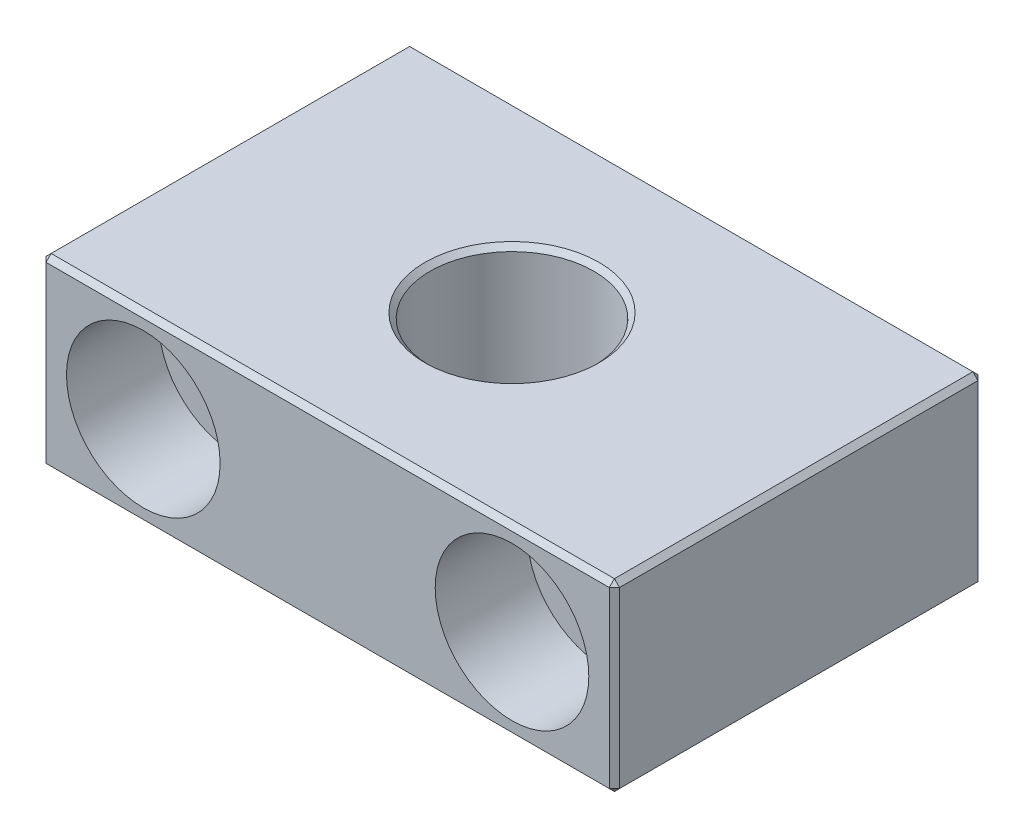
ISO-10303-21;
HEADER;
FILE_DESCRIPTION(('STEP AP214'),'2;1');
FILE_NAME('part.step','',(''),(''),'','','');
FILE_SCHEMA(('AUTOMOTIVE_DESIGN { 1 0 10303 214 1 1 1 1 }'));
ENDSEC;
DATA;
#1=APPLICATION_CONTEXT('core data for automotive mechanical design processes');
#2=APPLICATION_PROTOCOL_DEFINITION('international standard','automotive_design',2000,#1);
#3=PRODUCT_CONTEXT('',#1,'mechanical');
#4=PRODUCT('Part','Part','',(#3));
#5=PRODUCT_RELATED_PRODUCT_CATEGORY('part','',(#4));
#6=PRODUCT_DEFINITION_FORMATION('','',#4);
#7=PRODUCT_DEFINITION_CONTEXT('part definition',#1,'design');
#8=PRODUCT_DEFINITION('design','',#6,#7);
#9=PRODUCT_DEFINITION_SHAPE('','',#8);
#10=(LENGTH_UNIT() NAMED_UNIT(*) SI_UNIT(.MILLI.,.METRE.));
#11=(NAMED_UNIT(*) PLANE_ANGLE_UNIT() SI_UNIT($,.RADIAN.));
#12=(NAMED_UNIT(*) SI_UNIT($,.STERADIAN.) SOLID_ANGLE_UNIT());
#13=UNCERTAINTY_MEASURE_WITH_UNIT(LENGTH_MEASURE(1.E-05),#10,'distance_accuracy_value','');
#14=(GEOMETRIC_REPRESENTATION_CONTEXT(3) GLOBAL_UNCERTAINTY_ASSIGNED_CONTEXT((#13)) GLOBAL_UNIT_ASSIGNED_CONTEXT((#10,
#11,#12)) REPRESENTATION_CONTEXT('',''));
#15=CARTESIAN_POINT('',(0.,0.,0.));
#16=DIRECTION('',(0.,0.,1.));
#17=DIRECTION('',(1.,0.,0.));
#18=AXIS2_PLACEMENT_3D('',#15,#16,#17);
#19=CARTESIAN_POINT('',(28.,9.,36.));
#20=DIRECTION('',(-1.,0.,0.));
#21=DIRECTION('',(0.,0.,1.));
#22=AXIS2_PLACEMENT_3D('',#19,#20,#21);
#23=PLANE('',#22);
#24=DIRECTION('',(0.,0.,1.));
#25=VECTOR('',#24,1.);
#26=CARTESIAN_POINT('',(28.,8.5,36.));
#27=LINE('',#26,#25);
#28=CARTESIAN_POINT('',(28.,8.5,0.5));
#29=VERTEX_POINT('',#28);
#30=CARTESIAN_POINT('',(28.,8.5,35.5));
#31=VERTEX_POINT('',#30);
#32=EDGE_CURVE('E194',#29,#31,#27,.T.);
#33=ORIENTED_EDGE('',*,*,#32,.T.);
#34=DIRECTION('',(0.,-1.,0.));
#35=VECTOR('',#34,1.);
#36=CARTESIAN_POINT('',(28.,-9.,35.5));
#37=LINE('',#36,#35);
#38=CARTESIAN_POINT('',(28.,-8.5,35.5));
#39=VERTEX_POINT('',#38);
#40=EDGE_CURVE('E196',#31,#39,#37,.T.);
#41=ORIENTED_EDGE('',*,*,#40,.T.);
#42=DIRECTION('',(0.,0.,-1.));
#43=VECTOR('',#42,1.);
#44=CARTESIAN_POINT('',(28.,-8.5,36.));
#45=LINE('',#44,#43);
#46=CARTESIAN_POINT('',(28.,-8.5,0.5));
#47=VERTEX_POINT('',#46);
#48=EDGE_CURVE('E190',#39,#47,#45,.T.);
#49=ORIENTED_EDGE('',*,*,#48,.T.);
#50=DIRECTION('',(0.,1.,0.));
#51=VECTOR('',#50,1.);
#52=CARTESIAN_POINT('',(28.,9.,0.5));
#53=LINE('',#52,#51);
#54=EDGE_CURVE('E192',#47,#29,#53,.T.);
#55=ORIENTED_EDGE('',*,*,#54,.T.);
#56=EDGE_LOOP('',(#33,#41,#49,#55));
#57=FACE_BOUND('',#56,.T.);
#58=ADVANCED_FACE('F36',(#57),#23,.F.);
#59=CARTESIAN_POINT('',(-28.,9.,36.));
#60=DIRECTION('',(0.,-1.,0.));
#61=DIRECTION('',(0.,0.,-1.));
#62=AXIS2_PLACEMENT_3D('',#59,#60,#61);
#63=PLANE('',#62);
#64=CARTESIAN_POINT('',(0.,9.,18.));
#65=DIRECTION('',(0.,-1.,0.));
#66=DIRECTION('',(0.,0.,-1.));
#67=AXIS2_PLACEMENT_3D('',#64,#65,#66);
#68=CIRCLE('',#67,8.50000000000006);
#69=CARTESIAN_POINT('',(0.,9.,9.49999999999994));
#70=VERTEX_POINT('',#69);
#71=EDGE_CURVE('E171',#70,#70,#68,.T.);
#72=ORIENTED_EDGE('',*,*,#71,.T.);
#73=EDGE_LOOP('',(#72));
#74=FACE_BOUND('',#73,.T.);
#75=DIRECTION('',(1.,0.,0.));
#76=VECTOR('',#75,1.);
#77=CARTESIAN_POINT('',(28.,9.,35.5));
#78=LINE('',#77,#76);
#79=CARTESIAN_POINT('',(-27.5,9.,35.5));
#80=VERTEX_POINT('',#79);
#81=CARTESIAN_POINT('',(27.5,9.,35.5));
#82=VERTEX_POINT('',#81);
#83=EDGE_CURVE('E135',#80,#82,#78,.T.);
#84=ORIENTED_EDGE('',*,*,#83,.T.);
#85=DIRECTION('',(0.,0.,-1.));
#86=VECTOR('',#85,1.);
#87=CARTESIAN_POINT('',(27.5,9.,36.));
#88=LINE('',#87,#86);
#89=CARTESIAN_POINT('',(27.5,9.,0.5));
#90=VERTEX_POINT('',#89);
#91=EDGE_CURVE('E131',#82,#90,#88,.T.);
#92=ORIENTED_EDGE('',*,*,#91,.T.);
#93=DIRECTION('',(-1.,0.,0.));
#94=VECTOR('',#93,1.);
#95=CARTESIAN_POINT('',(-28.,9.,0.5));
#96=LINE('',#95,#94);
#97=CARTESIAN_POINT('',(-27.5,9.,0.5));
#98=VERTEX_POINT('',#97);
#99=EDGE_CURVE('E123',#90,#98,#96,.T.);
#100=ORIENTED_EDGE('',*,*,#99,.T.);
#101=DIRECTION('',(0.,0.,1.));
#102=VECTOR('',#101,1.);
#103=CARTESIAN_POINT('',(-27.5,9.,36.));
#104=LINE('',#103,#102);
#105=EDGE_CURVE('E128',#98,#80,#104,.T.);
#106=ORIENTED_EDGE('',*,*,#105,.T.);
#107=EDGE_LOOP('',(#84,#92,#100,#106));
#108=FACE_BOUND('',#107,.T.);
#109=ADVANCED_FACE('F126',(#74,#108),#63,.F.);
#110=CARTESIAN_POINT('',(-28.,9.,36.));
#111=DIRECTION('',(1.,0.,0.));
#112=DIRECTION('',(0.,0.,-1.));
#113=AXIS2_PLACEMENT_3D('',#110,#111,#112);
#114=PLANE('',#113);
#115=DIRECTION('',(0.,1.,0.));
#116=VECTOR('',#115,1.);
#117=CARTESIAN_POINT('',(-28.,9.,35.5));
#118=LINE('',#117,#116);
#119=CARTESIAN_POINT('',(-28.,-8.5,35.5));
#120=VERTEX_POINT('',#119);
#121=CARTESIAN_POINT('',(-28.,8.5,35.5));
#122=VERTEX_POINT('',#121);
#123=EDGE_CURVE('E203',#120,#122,#118,.T.);
#124=ORIENTED_EDGE('',*,*,#123,.T.);
#125=DIRECTION('',(0.,0.,-1.));
#126=VECTOR('',#125,1.);
#127=CARTESIAN_POINT('',(-28.,8.5,36.));
#128=LINE('',#127,#126);
#129=CARTESIAN_POINT('',(-28.,8.5,0.5));
#130=VERTEX_POINT('',#129);
#131=EDGE_CURVE('E205',#122,#130,#128,.T.);
#132=ORIENTED_EDGE('',*,*,#131,.T.);
#133=DIRECTION('',(0.,-1.,0.));
#134=VECTOR('',#133,1.);
#135=CARTESIAN_POINT('',(-28.,9.,0.5));
#136=LINE('',#135,#134);
#137=CARTESIAN_POINT('',(-28.,-8.5,0.5));
#138=VERTEX_POINT('',#137);
#139=EDGE_CURVE('E201',#130,#138,#136,.T.);
#140=ORIENTED_EDGE('',*,*,#139,.T.);
#141=DIRECTION('',(0.,0.,1.));
#142=VECTOR('',#141,1.);
#143=CARTESIAN_POINT('',(-28.,-8.5,36.));
#144=LINE('',#143,#142);
#145=EDGE_CURVE('E199',#138,#120,#144,.T.);
#146=ORIENTED_EDGE('',*,*,#145,.T.);
#147=EDGE_LOOP('',(#124,#132,#140,#146));
#148=FACE_BOUND('',#147,.T.);
#149=ADVANCED_FACE('F312',(#148),#114,.F.);
#150=CARTESIAN_POINT('',(-28.,-9.,36.));
#151=DIRECTION('',(0.,1.,0.));
#152=DIRECTION('',(0.,0.,1.));
#153=AXIS2_PLACEMENT_3D('',#150,#151,#152);
#154=PLANE('',#153);
#155=DIRECTION('',(-1.,0.,0.));
#156=VECTOR('',#155,1.);
#157=CARTESIAN_POINT('',(-28.,-9.,35.5));
#158=LINE('',#157,#156);
#159=CARTESIAN_POINT('',(27.5,-9.,35.5));
#160=VERTEX_POINT('',#159);
#161=CARTESIAN_POINT('',(-27.5,-9.,35.5));
#162=VERTEX_POINT('',#161);
#163=EDGE_CURVE('E45',#160,#162,#158,.T.);
#164=ORIENTED_EDGE('',*,*,#163,.T.);
#165=DIRECTION('',(0.,0.,-1.));
#166=VECTOR('',#165,1.);
#167=CARTESIAN_POINT('',(-27.5,-9.,36.));
#168=LINE('',#167,#166);
#169=CARTESIAN_POINT('',(-27.5,-9.,0.5));
#170=VERTEX_POINT('',#169);
#171=EDGE_CURVE('E11',#162,#170,#168,.T.);
#172=ORIENTED_EDGE('',*,*,#171,.T.);
#173=DIRECTION('',(1.,0.,0.));
#174=VECTOR('',#173,1.);
#175=CARTESIAN_POINT('',(-28.,-9.,0.5));
#176=LINE('',#175,#174);
#177=CARTESIAN_POINT('',(27.5,-9.,0.5));
#178=VERTEX_POINT('',#177);
#179=EDGE_CURVE('E211',#170,#178,#176,.T.);
#180=ORIENTED_EDGE('',*,*,#179,.T.);
#181=DIRECTION('',(0.,0.,1.));
#182=VECTOR('',#181,1.);
#183=CARTESIAN_POINT('',(27.5,-9.,36.));
#184=LINE('',#183,#182);
#185=EDGE_CURVE('E56',#178,#160,#184,.T.);
#186=ORIENTED_EDGE('',*,*,#185,.T.);
#187=EDGE_LOOP('',(#164,#172,#180,#186));
#188=FACE_BOUND('',#187,.T.);
#189=CARTESIAN_POINT('',(0.,-9.,18.));
#190=DIRECTION('',(0.,1.,0.));
#191=DIRECTION('',(0.,0.,1.));
#192=AXIS2_PLACEMENT_3D('',#189,#190,#191);
#193=CIRCLE('',#192,8.49999999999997);
#194=CARTESIAN_POINT('',(0.,-9.,26.5));
#195=VERTEX_POINT('',#194);
#196=EDGE_CURVE('E208',#195,#195,#193,.T.);
#197=ORIENTED_EDGE('',*,*,#196,.T.);
#198=EDGE_LOOP('',(#197));
#199=FACE_BOUND('',#198,.T.);
#200=ADVANCED_FACE('F309',(#188,#199),#154,.F.);
#201=CARTESIAN_POINT('',(28.,-9.,36.));
#202=DIRECTION('',(0.,0.,1.));
#203=DIRECTION('',(1.,0.,0.));
#204=AXIS2_PLACEMENT_3D('',#201,#202,#203);
#205=PLANE('',#204);
#206=DIRECTION('',(0.,1.,0.));
#207=VECTOR('',#206,1.);
#208=CARTESIAN_POINT('',(27.5,9.,36.));
#209=LINE('',#208,#207);
#210=CARTESIAN_POINT('',(27.5,-8.5,36.));
#211=VERTEX_POINT('',#210);
#212=CARTESIAN_POINT('',(27.5,8.5,36.));
#213=VERTEX_POINT('',#212);
#214=EDGE_CURVE('E178',#211,#213,#209,.T.);
#215=ORIENTED_EDGE('',*,*,#214,.T.);
#216=DIRECTION('',(-1.,0.,0.));
#217=VECTOR('',#216,1.);
#218=CARTESIAN_POINT('',(-28.,8.5,36.));
#219=LINE('',#218,#217);
#220=CARTESIAN_POINT('',(-27.5,8.5,36.));
#221=VERTEX_POINT('',#220);
#222=EDGE_CURVE('E180',#213,#221,#219,.T.);
#223=ORIENTED_EDGE('',*,*,#222,.T.);
#224=DIRECTION('',(0.,-1.,0.));
#225=VECTOR('',#224,1.);
#226=CARTESIAN_POINT('',(-27.5,-9.,36.));
#227=LINE('',#226,#225);
#228=CARTESIAN_POINT('',(-27.5,-8.5,36.));
#229=VERTEX_POINT('',#228);
#230=EDGE_CURVE('E176',#221,#229,#227,.T.);
#231=ORIENTED_EDGE('',*,*,#230,.T.);
#232=DIRECTION('',(1.,0.,0.));
#233=VECTOR('',#232,1.);
#234=CARTESIAN_POINT('',(28.,-8.5,36.));
#235=LINE('',#234,#233);
#236=EDGE_CURVE('E174',#229,#211,#235,.T.);
#237=ORIENTED_EDGE('',*,*,#236,.T.);
#238=EDGE_LOOP('',(#215,#223,#231,#237));
#239=FACE_BOUND('',#238,.T.);
#240=CARTESIAN_POINT('',(-18.,-0.01,36.));
#241=DIRECTION('',(0.,0.,1.));
#242=DIRECTION('',(1.,0.,0.));
#243=AXIS2_PLACEMENT_3D('',#240,#241,#242);
#244=CIRCLE('',#243,7.5);
#245=CARTESIAN_POINT('',(-10.5,-0.01,36.));
#246=VERTEX_POINT('',#245);
#247=EDGE_CURVE('E269',#246,#246,#244,.T.);
#248=ORIENTED_EDGE('',*,*,#247,.F.);
#249=EDGE_LOOP('',(#248));
#250=FACE_BOUND('',#249,.T.);
#251=CARTESIAN_POINT('',(18.,-0.01,36.));
#252=DIRECTION('',(0.,0.,1.));
#253=DIRECTION('',(1.,0.,0.));
#254=AXIS2_PLACEMENT_3D('',#251,#252,#253);
#255=CIRCLE('',#254,7.5);
#256=CARTESIAN_POINT('',(25.5,-0.01,36.));
#257=VERTEX_POINT('',#256);
#258=EDGE_CURVE('E285',#257,#257,#255,.T.);
#259=ORIENTED_EDGE('',*,*,#258,.F.);
#260=EDGE_LOOP('',(#259));
#261=FACE_BOUND('',#260,.T.);
#262=ADVANCED_FACE('F311',(#239,#250,#261),#205,.T.);
#263=CARTESIAN_POINT('',(28.,-9.,0.));
#264=DIRECTION('',(0.,0.,1.));
#265=DIRECTION('',(1.,0.,0.));
#266=AXIS2_PLACEMENT_3D('',#263,#264,#265);
#267=PLANE('',#266);
#268=DIRECTION('',(0.,1.,0.));
#269=VECTOR('',#268,1.);
#270=CARTESIAN_POINT('',(-27.5,-9.,0.));
#271=LINE('',#270,#269);
#272=CARTESIAN_POINT('',(-27.5,-8.5,0.));
#273=VERTEX_POINT('',#272);
#274=CARTESIAN_POINT('',(-27.5,8.5,0.));
#275=VERTEX_POINT('',#274);
#276=EDGE_CURVE('E185',#273,#275,#271,.T.);
#277=ORIENTED_EDGE('',*,*,#276,.T.);
#278=DIRECTION('',(1.,0.,0.));
#279=VECTOR('',#278,1.);
#280=CARTESIAN_POINT('',(28.,8.5,0.));
#281=LINE('',#280,#279);
#282=CARTESIAN_POINT('',(27.5,8.5,0.));
#283=VERTEX_POINT('',#282);
#284=EDGE_CURVE('E143',#275,#283,#281,.T.);
#285=ORIENTED_EDGE('',*,*,#284,.T.);
#286=DIRECTION('',(0.,-1.,0.));
#287=VECTOR('',#286,1.);
#288=CARTESIAN_POINT('',(27.5,-9.,0.));
#289=LINE('',#288,#287);
#290=CARTESIAN_POINT('',(27.5,-8.5,0.));
#291=VERTEX_POINT('',#290);
#292=EDGE_CURVE('E187',#283,#291,#289,.T.);
#293=ORIENTED_EDGE('',*,*,#292,.T.);
#294=DIRECTION('',(-1.,0.,0.));
#295=VECTOR('',#294,1.);
#296=CARTESIAN_POINT('',(28.,-8.5,0.));
#297=LINE('',#296,#295);
#298=EDGE_CURVE('E183',#291,#273,#297,.T.);
#299=ORIENTED_EDGE('',*,*,#298,.T.);
#300=EDGE_LOOP('',(#277,#285,#293,#299));
#301=FACE_BOUND('',#300,.T.);
#302=CARTESIAN_POINT('',(18.,-0.01,0.));
#303=DIRECTION('',(0.,0.,1.));
#304=DIRECTION('',(1.,0.,0.));
#305=AXIS2_PLACEMENT_3D('',#302,#303,#304);
#306=CIRCLE('',#305,4.5);
#307=CARTESIAN_POINT('',(22.5,-0.01,0.));
#308=VERTEX_POINT('',#307);
#309=EDGE_CURVE('E294',#308,#308,#306,.T.);
#310=ORIENTED_EDGE('',*,*,#309,.T.);
#311=EDGE_LOOP('',(#310));
#312=FACE_BOUND('',#311,.T.);
#313=CARTESIAN_POINT('',(-18.,-0.01,0.));
#314=DIRECTION('',(0.,0.,1.));
#315=DIRECTION('',(1.,0.,0.));
#316=AXIS2_PLACEMENT_3D('',#313,#314,#315);
#317=CIRCLE('',#316,4.5);
#318=CARTESIAN_POINT('',(-13.5,-0.01,0.));
#319=VERTEX_POINT('',#318);
#320=EDGE_CURVE('E297',#319,#319,#317,.T.);
#321=ORIENTED_EDGE('',*,*,#320,.T.);
#322=EDGE_LOOP('',(#321));
#323=FACE_BOUND('',#322,.T.);
#324=ADVANCED_FACE('F318',(#301,#312,#323),#267,.F.);
#325=CARTESIAN_POINT('',(-18.,-0.01,0.));
#326=DIRECTION('',(0.,0.,1.));
#327=DIRECTION('',(1.,0.,0.));
#328=AXIS2_PLACEMENT_3D('',#325,#326,#327);
#329=CYLINDRICAL_SURFACE('',#328,4.5);
#330=CARTESIAN_POINT('',(-18.,-0.01,27.));
#331=DIRECTION('',(0.,0.,1.));
#332=DIRECTION('',(1.,0.,0.));
#333=AXIS2_PLACEMENT_3D('',#330,#331,#332);
#334=CIRCLE('',#333,4.5);
#335=CARTESIAN_POINT('',(-13.5,-0.01,27.));
#336=VERTEX_POINT('',#335);
#337=EDGE_CURVE('E280',#336,#336,#334,.T.);
#338=ORIENTED_EDGE('',*,*,#337,.T.);
#339=EDGE_LOOP('',(#338));
#340=FACE_BOUND('',#339,.T.);
#341=ORIENTED_EDGE('',*,*,#320,.F.);
#342=EDGE_LOOP('',(#341));
#343=FACE_BOUND('',#342,.T.);
#344=ADVANCED_FACE('F464',(#340,#343),#329,.F.);
#345=CARTESIAN_POINT('',(18.,-0.01,0.));
#346=DIRECTION('',(0.,0.,1.));
#347=DIRECTION('',(1.,0.,0.));
#348=AXIS2_PLACEMENT_3D('',#345,#346,#347);
#349=CYLINDRICAL_SURFACE('',#348,4.5);
#350=CARTESIAN_POINT('',(18.,-0.01,27.));
#351=DIRECTION('',(0.,0.,1.));
#352=DIRECTION('',(1.,0.,0.));
#353=AXIS2_PLACEMENT_3D('',#350,#351,#352);
#354=CIRCLE('',#353,4.5);
#355=CARTESIAN_POINT('',(22.5,-0.01,27.));
#356=VERTEX_POINT('',#355);
#357=EDGE_CURVE('E291',#356,#356,#354,.T.);
#358=ORIENTED_EDGE('',*,*,#357,.T.);
#359=EDGE_LOOP('',(#358));
#360=FACE_BOUND('',#359,.T.);
#361=ORIENTED_EDGE('',*,*,#309,.F.);
#362=EDGE_LOOP('',(#361));
#363=FACE_BOUND('',#362,.T.);
#364=ADVANCED_FACE('F460',(#360,#363),#349,.F.);
#365=CARTESIAN_POINT('',(0.,-12.,18.));
#366=DIRECTION('',(0.,1.,0.));
#367=DIRECTION('',(0.,0.,1.));
#368=AXIS2_PLACEMENT_3D('',#365,#366,#367);
#369=CYLINDRICAL_SURFACE('',#368,8.);
#370=CARTESIAN_POINT('',(0.,8.49999999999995,18.));
#371=DIRECTION('',(0.,-1.,0.));
#372=DIRECTION('',(0.,0.,-1.));
#373=AXIS2_PLACEMENT_3D('',#370,#371,#372);
#374=CIRCLE('',#373,8.);
#375=CARTESIAN_POINT('',(0.,8.49999999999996,26.));
#376=VERTEX_POINT('',#375);
#377=EDGE_CURVE('E162',#376,#376,#374,.F.);
#378=CARTESIAN_POINT('',(0.,-8.50000000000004,18.));
#379=DIRECTION('',(0.,1.,0.));
#380=DIRECTION('',(0.,0.,1.));
#381=AXIS2_PLACEMENT_3D('',#378,#379,#380);
#382=CIRCLE('',#381,8.);
#383=CARTESIAN_POINT('',(0.,-8.50000000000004,26.));
#384=VERTEX_POINT('',#383);
#385=EDGE_CURVE('E165',#384,#384,#382,.F.);
#386=CARTESIAN_POINT('',(0.,8.49999999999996,26.));
#387=CARTESIAN_POINT('',(0.,8.32291666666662,26.));
#388=CARTESIAN_POINT('',(0.,8.14583333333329,26.));
#389=CARTESIAN_POINT('',(0.,7.79166666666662,26.));
#390=CARTESIAN_POINT('',(0.,7.61458333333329,26.));
#391=CARTESIAN_POINT('',(0.,7.26041666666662,26.));
#392=CARTESIAN_POINT('',(0.,7.08333333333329,26.));
#393=CARTESIAN_POINT('',(0.,6.72916666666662,26.));
#394=CARTESIAN_POINT('',(0.,6.55208333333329,26.));
#395=CARTESIAN_POINT('',(0.,6.19791666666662,26.));
#396=CARTESIAN_POINT('',(0.,6.02083333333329,26.));
#397=CARTESIAN_POINT('',(0.,5.66666666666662,26.));
#398=CARTESIAN_POINT('',(0.,5.48958333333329,26.));
#399=CARTESIAN_POINT('',(0.,5.13541666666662,26.));
#400=CARTESIAN_POINT('',(0.,4.95833333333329,26.));
#401=CARTESIAN_POINT('',(0.,4.60416666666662,26.));
#402=CARTESIAN_POINT('',(0.,4.42708333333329,26.));
#403=CARTESIAN_POINT('',(0.,4.07291666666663,26.));
#404=CARTESIAN_POINT('',(0.,3.89583333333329,26.));
#405=CARTESIAN_POINT('',(0.,3.54166666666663,26.));
#406=CARTESIAN_POINT('',(0.,3.36458333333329,26.));
#407=CARTESIAN_POINT('',(0.,3.01041666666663,26.));
#408=CARTESIAN_POINT('',(0.,2.83333333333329,26.));
#409=CARTESIAN_POINT('',(0.,2.47916666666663,26.));
#410=CARTESIAN_POINT('',(0.,2.30208333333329,26.));
#411=CARTESIAN_POINT('',(0.,1.94791666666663,26.));
#412=CARTESIAN_POINT('',(0.,1.77083333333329,26.));
#413=CARTESIAN_POINT('',(0.,1.41666666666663,26.));
#414=CARTESIAN_POINT('',(0.,1.23958333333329,26.));
#415=CARTESIAN_POINT('',(0.,0.885416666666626,26.));
#416=CARTESIAN_POINT('',(0.,0.708333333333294,26.));
#417=CARTESIAN_POINT('',(0.,0.354166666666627,26.));
#418=CARTESIAN_POINT('',(0.,0.177083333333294,26.));
#419=CARTESIAN_POINT('',(0.,-0.177083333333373,26.));
#420=CARTESIAN_POINT('',(0.,-0.354166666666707,26.));
#421=CARTESIAN_POINT('',(0.,-0.708333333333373,26.));
#422=CARTESIAN_POINT('',(0.,-0.885416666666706,26.));
#423=CARTESIAN_POINT('',(0.,-1.23958333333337,26.));
#424=CARTESIAN_POINT('',(0.,-1.41666666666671,26.));
#425=CARTESIAN_POINT('',(0.,-1.77083333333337,26.));
#426=CARTESIAN_POINT('',(0.,-1.94791666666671,26.));
#427=CARTESIAN_POINT('',(0.,-2.30208333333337,26.));
#428=CARTESIAN_POINT('',(0.,-2.47916666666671,26.));
#429=CARTESIAN_POINT('',(0.,-2.83333333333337,26.));
#430=CARTESIAN_POINT('',(0.,-3.01041666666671,26.));
#431=CARTESIAN_POINT('',(0.,-3.36458333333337,26.));
#432=CARTESIAN_POINT('',(0.,-3.54166666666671,26.));
#433=CARTESIAN_POINT('',(0.,-3.89583333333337,26.));
#434=CARTESIAN_POINT('',(0.,-4.0729166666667,26.));
#435=CARTESIAN_POINT('',(0.,-4.42708333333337,26.));
#436=CARTESIAN_POINT('',(0.,-4.6041666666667,26.));
#437=CARTESIAN_POINT('',(0.,-4.95833333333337,26.));
#438=CARTESIAN_POINT('',(0.,-5.1354166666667,26.));
#439=CARTESIAN_POINT('',(0.,-5.48958333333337,26.));
#440=CARTESIAN_POINT('',(0.,-5.6666666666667,26.));
#441=CARTESIAN_POINT('',(0.,-6.02083333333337,26.));
#442=CARTESIAN_POINT('',(0.,-6.1979166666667,26.));
#443=CARTESIAN_POINT('',(0.,-6.55208333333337,26.));
#444=CARTESIAN_POINT('',(0.,-6.7291666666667,26.));
#445=CARTESIAN_POINT('',(0.,-7.08333333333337,26.));
#446=CARTESIAN_POINT('',(0.,-7.2604166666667,26.));
#447=CARTESIAN_POINT('',(0.,-7.61458333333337,26.));
#448=CARTESIAN_POINT('',(0.,-7.7916666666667,26.));
#449=CARTESIAN_POINT('',(0.,-8.14583333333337,26.));
#450=CARTESIAN_POINT('',(0.,-8.3229166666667,26.));
#451=CARTESIAN_POINT('',(0.,-8.50000000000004,26.));
#452=B_SPLINE_CURVE_WITH_KNOTS('',3,(#386,#387,#388,#389,#390,#391,#392,#393,#394,#395,#396,
#397,#398,#399,#400,#401,#402,#403,#404,#405,#406,#407,#408,#409,#410,#411,#412,#413,#414,#415,
#416,#417,#418,#419,#420,#421,#422,#423,#424,#425,#426,#427,#428,#429,#430,#431,#432,#433,#434,
#435,#436,#437,#438,#439,#440,#441,#442,#443,#444,#445,#446,#447,#448,#449,#450,#451),
.UNSPECIFIED.,.F.,.F.,(4,2,2,2,2,2,2,2,2,2,2,2,2,2,2,2,2,2,2,2,2,2,2,2,2,2,2,2,2,2,2,2,4),(0.,
0.53125,1.0625,1.59375,2.125,2.65625,3.1875,3.71875,4.25,4.78125,5.3125,5.84375,6.375,6.90625,
7.4375,7.96874999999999,8.49999999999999,9.03125,9.56249999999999,10.09375,10.625,11.15625,
11.6875,12.21875,12.75,13.28125,13.8125,14.34375,14.875,15.40625,15.9375,16.46875,17.),.UNSPECIFIED.);
#453=EDGE_CURVE('BSEAM302',#376,#384,#452,.T.);
#454=ORIENTED_EDGE('',*,*,#377,.T.);
#455=ORIENTED_EDGE('',*,*,#385,.T.);
#456=ORIENTED_EDGE('',*,*,#453,.T.);
#457=ORIENTED_EDGE('',*,*,#453,.F.);
#458=EDGE_LOOP('',(#454,#456,#455,#457));
#459=FACE_BOUND('',#458,.T.);
#460=ADVANCED_FACE('F302',(#459),#369,.F.);
#461=CARTESIAN_POINT('',(22.5,-0.01,27.));
#462=DIRECTION('',(0.,0.,-1.));
#463=DIRECTION('',(-1.,0.,0.));
#464=AXIS2_PLACEMENT_3D('',#461,#462,#463);
#465=PLANE('',#464);
#466=ORIENTED_EDGE('',*,*,#357,.F.);
#467=EDGE_LOOP('',(#466));
#468=FACE_BOUND('',#467,.T.);
#469=CARTESIAN_POINT('',(18.,-0.01,27.));
#470=DIRECTION('',(0.,0.,1.));
#471=DIRECTION('',(1.,0.,0.));
#472=AXIS2_PLACEMENT_3D('',#469,#470,#471);
#473=CIRCLE('',#472,7.5);
#474=CARTESIAN_POINT('',(25.5,-0.01,27.));
#475=VERTEX_POINT('',#474);
#476=EDGE_CURVE('E288',#475,#475,#473,.T.);
#477=ORIENTED_EDGE('',*,*,#476,.T.);
#478=EDGE_LOOP('',(#477));
#479=FACE_BOUND('',#478,.T.);
#480=ADVANCED_FACE('F444',(#468,#479),#465,.F.);
#481=CARTESIAN_POINT('',(18.,-0.01,36.));
#482=DIRECTION('',(0.,0.,1.));
#483=DIRECTION('',(1.,0.,0.));
#484=AXIS2_PLACEMENT_3D('',#481,#482,#483);
#485=CYLINDRICAL_SURFACE('',#484,7.5);
#486=ORIENTED_EDGE('',*,*,#476,.F.);
#487=EDGE_LOOP('',(#486));
#488=FACE_BOUND('',#487,.T.);
#489=ORIENTED_EDGE('',*,*,#258,.T.);
#490=EDGE_LOOP('',(#489));
#491=FACE_BOUND('',#490,.T.);
#492=ADVANCED_FACE('F441',(#488,#491),#485,.F.);
#493=CARTESIAN_POINT('',(-13.5,-0.01,27.));
#494=DIRECTION('',(0.,0.,-1.));
#495=DIRECTION('',(-1.,0.,0.));
#496=AXIS2_PLACEMENT_3D('',#493,#494,#495);
#497=PLANE('',#496);
#498=ORIENTED_EDGE('',*,*,#337,.F.);
#499=EDGE_LOOP('',(#498));
#500=FACE_BOUND('',#499,.T.);
#501=CARTESIAN_POINT('',(-18.,-0.01,27.));
#502=DIRECTION('',(0.,0.,1.));
#503=DIRECTION('',(1.,0.,0.));
#504=AXIS2_PLACEMENT_3D('',#501,#502,#503);
#505=CIRCLE('',#504,7.5);
#506=CARTESIAN_POINT('',(-10.5,-0.01,27.));
#507=VERTEX_POINT('',#506);
#508=EDGE_CURVE('E275',#507,#507,#505,.T.);
#509=ORIENTED_EDGE('',*,*,#508,.T.);
#510=EDGE_LOOP('',(#509));
#511=FACE_BOUND('',#510,.T.);
#512=ADVANCED_FACE('F443',(#500,#511),#497,.F.);
#513=CARTESIAN_POINT('',(-18.,-0.01,36.));
#514=DIRECTION('',(0.,0.,1.));
#515=DIRECTION('',(1.,0.,0.));
#516=AXIS2_PLACEMENT_3D('',#513,#514,#515);
#517=CYLINDRICAL_SURFACE('',#516,7.5);
#518=ORIENTED_EDGE('',*,*,#508,.F.);
#519=EDGE_LOOP('',(#518));
#520=FACE_BOUND('',#519,.T.);
#521=ORIENTED_EDGE('',*,*,#247,.T.);
#522=EDGE_LOOP('',(#521));
#523=FACE_BOUND('',#522,.T.);
#524=ADVANCED_FACE('F337',(#520,#523),#517,.F.);
#525=CARTESIAN_POINT('',(0.,8.49999999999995,18.));
#526=DIRECTION('',(0.,1.,0.));
#527=DIRECTION('',(0.,0.,1.));
#528=AXIS2_PLACEMENT_3D('',#525,#526,#527);
#529=CONICAL_SURFACE('',#528,8.,0.785398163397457);
#530=ORIENTED_EDGE('',*,*,#71,.F.);
#531=EDGE_LOOP('',(#530));
#532=FACE_BOUND('',#531,.T.);
#533=ORIENTED_EDGE('',*,*,#377,.F.);
#534=EDGE_LOOP('',(#533));
#535=FACE_BOUND('',#534,.T.);
#536=ADVANCED_FACE('F333',(#532,#535),#529,.F.);
#537=CARTESIAN_POINT('',(-28.,-9.,0.5));
#538=DIRECTION('',(0.,0.707106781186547,0.707106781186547));
#539=DIRECTION('',(1.,0.,0.));
#540=AXIS2_PLACEMENT_3D('',#537,#538,#539);
#541=PLANE('',#540);
#542=DIRECTION('',(0.,-0.707106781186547,0.707106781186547));
#543=VECTOR('',#542,1.);
#544=CARTESIAN_POINT('',(27.5,-8.5,0.));
#545=LINE('',#544,#543);
#546=EDGE_CURVE('E40',#178,#291,#545,.F.);
#547=ORIENTED_EDGE('',*,*,#546,.F.);
#548=ORIENTED_EDGE('',*,*,#179,.F.);
#549=DIRECTION('',(0.,0.707106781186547,-0.707106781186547));
#550=VECTOR('',#549,1.);
#551=CARTESIAN_POINT('',(-27.5,-8.75,0.25));
#552=LINE('',#551,#550);
#553=EDGE_CURVE('E261',#273,#170,#552,.F.);
#554=ORIENTED_EDGE('',*,*,#553,.F.);
#555=ORIENTED_EDGE('',*,*,#298,.F.);
#556=EDGE_LOOP('',(#547,#548,#554,#555));
#557=FACE_BOUND('',#556,.T.);
#558=ADVANCED_FACE('F336',(#557),#541,.F.);
#559=CARTESIAN_POINT('',(27.5,-8.5,0.));
#560=DIRECTION('',(0.577350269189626,-0.577350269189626,-0.577350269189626));
#561=DIRECTION('',(-0.707106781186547,0.,-0.707106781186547));
#562=AXIS2_PLACEMENT_3D('',#559,#560,#561);
#563=PLANE('',#562);
#564=DIRECTION('',(0.707106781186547,0.707106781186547,0.));
#565=VECTOR('',#564,1.);
#566=CARTESIAN_POINT('',(27.75,-8.75,0.5));
#567=LINE('',#566,#565);
#568=EDGE_CURVE('E256',#178,#47,#567,.T.);
#569=ORIENTED_EDGE('',*,*,#568,.F.);
#570=ORIENTED_EDGE('',*,*,#546,.T.);
#571=DIRECTION('',(-0.707106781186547,0.,-0.707106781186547));
#572=VECTOR('',#571,1.);
#573=CARTESIAN_POINT('',(27.5,-8.5,0.));
#574=LINE('',#573,#572);
#575=EDGE_CURVE('E259',#47,#291,#574,.T.);
#576=ORIENTED_EDGE('',*,*,#575,.F.);
#577=EDGE_LOOP('',(#569,#570,#576));
#578=FACE_BOUND('',#577,.T.);
#579=ADVANCED_FACE('F403',(#578),#563,.T.);
#580=CARTESIAN_POINT('',(-28.,-8.5,0.5));
#581=DIRECTION('',(-0.577350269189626,-0.577350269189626,-0.577350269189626));
#582=DIRECTION('',(-0.707106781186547,0.,0.707106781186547));
#583=AXIS2_PLACEMENT_3D('',#580,#581,#582);
#584=PLANE('',#583);
#585=DIRECTION('',(-0.707106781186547,0.,0.707106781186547));
#586=VECTOR('',#585,1.);
#587=CARTESIAN_POINT('',(-28.,-8.5,0.5));
#588=LINE('',#587,#586);
#589=EDGE_CURVE('E251',#273,#138,#588,.T.);
#590=ORIENTED_EDGE('',*,*,#589,.F.);
#591=ORIENTED_EDGE('',*,*,#553,.T.);
#592=DIRECTION('',(0.707106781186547,-0.707106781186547,0.));
#593=VECTOR('',#592,1.);
#594=CARTESIAN_POINT('',(-28.,-8.5,0.5));
#595=LINE('',#594,#593);
#596=EDGE_CURVE('E254',#138,#170,#595,.T.);
#597=ORIENTED_EDGE('',*,*,#596,.F.);
#598=EDGE_LOOP('',(#590,#591,#597));
#599=FACE_BOUND('',#598,.T.);
#600=ADVANCED_FACE('F399',(#599),#584,.T.);
#601=CARTESIAN_POINT('',(28.,9.,0.5));
#602=DIRECTION('',(-0.707106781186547,0.,0.707106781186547));
#603=DIRECTION('',(0.,1.,0.));
#604=AXIS2_PLACEMENT_3D('',#601,#602,#603);
#605=PLANE('',#604);
#606=ORIENTED_EDGE('',*,*,#575,.T.);
#607=ORIENTED_EDGE('',*,*,#292,.F.);
#608=DIRECTION('',(0.707106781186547,0.,0.707106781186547));
#609=VECTOR('',#608,1.);
#610=CARTESIAN_POINT('',(27.5,8.5,0.));
#611=LINE('',#610,#609);
#612=EDGE_CURVE('E247',#29,#283,#611,.F.);
#613=ORIENTED_EDGE('',*,*,#612,.F.);
#614=ORIENTED_EDGE('',*,*,#54,.F.);
#615=EDGE_LOOP('',(#606,#607,#613,#614));
#616=FACE_BOUND('',#615,.T.);
#617=ADVANCED_FACE('F395',(#616),#605,.F.);
#618=CARTESIAN_POINT('',(28.,-8.5,36.));
#619=DIRECTION('',(-0.707106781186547,0.707106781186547,0.));
#620=DIRECTION('',(0.,0.,-1.));
#621=AXIS2_PLACEMENT_3D('',#618,#619,#620);
#622=PLANE('',#621);
#623=ORIENTED_EDGE('',*,*,#568,.T.);
#624=ORIENTED_EDGE('',*,*,#48,.F.);
#625=DIRECTION('',(-0.707106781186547,-0.707106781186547,0.));
#626=VECTOR('',#625,1.);
#627=CARTESIAN_POINT('',(28.,-8.5,35.5));
#628=LINE('',#627,#626);
#629=EDGE_CURVE('E244',#160,#39,#628,.F.);
#630=ORIENTED_EDGE('',*,*,#629,.F.);
#631=ORIENTED_EDGE('',*,*,#185,.F.);
#632=EDGE_LOOP('',(#623,#624,#630,#631));
#633=FACE_BOUND('',#632,.T.);
#634=ADVANCED_FACE('F391',(#633),#622,.F.);
#635=CARTESIAN_POINT('',(28.,-8.5,36.));
#636=DIRECTION('',(0.,-0.707106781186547,0.707106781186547));
#637=DIRECTION('',(-1.,0.,0.));
#638=AXIS2_PLACEMENT_3D('',#635,#636,#637);
#639=PLANE('',#638);
#640=DIRECTION('',(0.,0.707106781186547,0.707106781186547));
#641=VECTOR('',#640,1.);
#642=CARTESIAN_POINT('',(-27.5,-8.5,36.));
#643=LINE('',#642,#641);
#644=EDGE_CURVE('E238',#162,#229,#643,.T.);
#645=ORIENTED_EDGE('',*,*,#644,.F.);
#646=ORIENTED_EDGE('',*,*,#163,.F.);
#647=DIRECTION('',(0.,-0.707106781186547,-0.707106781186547));
#648=VECTOR('',#647,1.);
#649=CARTESIAN_POINT('',(27.5,-8.75,35.75));
#650=LINE('',#649,#648);
#651=EDGE_CURVE('E241',#211,#160,#650,.T.);
#652=ORIENTED_EDGE('',*,*,#651,.F.);
#653=ORIENTED_EDGE('',*,*,#236,.F.);
#654=EDGE_LOOP('',(#645,#646,#652,#653));
#655=FACE_BOUND('',#654,.T.);
#656=ADVANCED_FACE('F387',(#655),#639,.T.);
#657=CARTESIAN_POINT('',(-27.5,-9.,36.));
#658=DIRECTION('',(0.707106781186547,0.707106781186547,0.));
#659=DIRECTION('',(0.,0.,-1.));
#660=AXIS2_PLACEMENT_3D('',#657,#658,#659);
#661=PLANE('',#660);
#662=ORIENTED_EDGE('',*,*,#596,.T.);
#663=ORIENTED_EDGE('',*,*,#171,.F.);
#664=DIRECTION('',(-0.707106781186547,0.707106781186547,0.));
#665=VECTOR('',#664,1.);
#666=CARTESIAN_POINT('',(-27.75,-8.75,35.5));
#667=LINE('',#666,#665);
#668=EDGE_CURVE('E235',#120,#162,#667,.F.);
#669=ORIENTED_EDGE('',*,*,#668,.F.);
#670=ORIENTED_EDGE('',*,*,#145,.F.);
#671=EDGE_LOOP('',(#662,#663,#669,#670));
#672=FACE_BOUND('',#671,.T.);
#673=ADVANCED_FACE('F383',(#672),#661,.F.);
#674=CARTESIAN_POINT('',(-28.,9.,0.5));
#675=DIRECTION('',(0.707106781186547,0.,0.707106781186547));
#676=DIRECTION('',(0.,-1.,0.));
#677=AXIS2_PLACEMENT_3D('',#674,#675,#676);
#678=PLANE('',#677);
#679=ORIENTED_EDGE('',*,*,#589,.T.);
#680=ORIENTED_EDGE('',*,*,#139,.F.);
#681=DIRECTION('',(0.707106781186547,0.,-0.707106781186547));
#682=VECTOR('',#681,1.);
#683=CARTESIAN_POINT('',(-27.75,8.5,0.25));
#684=LINE('',#683,#682);
#685=EDGE_CURVE('E147',#275,#130,#684,.F.);
#686=ORIENTED_EDGE('',*,*,#685,.F.);
#687=ORIENTED_EDGE('',*,*,#276,.F.);
#688=EDGE_LOOP('',(#679,#680,#686,#687));
#689=FACE_BOUND('',#688,.T.);
#690=ADVANCED_FACE('F380',(#689),#678,.F.);
#691=CARTESIAN_POINT('',(-28.,9.,0.5));
#692=DIRECTION('',(0.,-0.707106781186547,0.707106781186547));
#693=DIRECTION('',(-1.,0.,0.));
#694=AXIS2_PLACEMENT_3D('',#691,#692,#693);
#695=PLANE('',#694);
#696=DIRECTION('',(0.,-0.707106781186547,-0.707106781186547));
#697=VECTOR('',#696,1.);
#698=CARTESIAN_POINT('',(27.5,8.5,0.));
#699=LINE('',#698,#697);
#700=EDGE_CURVE('E249',#283,#90,#699,.F.);
#701=ORIENTED_EDGE('',*,*,#700,.F.);
#702=ORIENTED_EDGE('',*,*,#284,.F.);
#703=DIRECTION('',(0.,0.707106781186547,0.707106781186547));
#704=VECTOR('',#703,1.);
#705=CARTESIAN_POINT('',(-27.5,9.,0.5));
#706=LINE('',#705,#704);
#707=EDGE_CURVE('E139',#98,#275,#706,.F.);
#708=ORIENTED_EDGE('',*,*,#707,.F.);
#709=ORIENTED_EDGE('',*,*,#99,.F.);
#710=EDGE_LOOP('',(#701,#702,#708,#709));
#711=FACE_BOUND('',#710,.T.);
#712=ADVANCED_FACE('F141',(#711),#695,.F.);
#713=CARTESIAN_POINT('',(27.5,8.5,0.));
#714=DIRECTION('',(0.577350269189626,0.577350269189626,-0.577350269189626));
#715=DIRECTION('',(-0.707106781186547,0.,-0.707106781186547));
#716=AXIS2_PLACEMENT_3D('',#713,#714,#715);
#717=PLANE('',#716);
#718=ORIENTED_EDGE('',*,*,#612,.T.);
#719=ORIENTED_EDGE('',*,*,#700,.T.);
#720=DIRECTION('',(-0.707106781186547,0.707106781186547,0.));
#721=VECTOR('',#720,1.);
#722=CARTESIAN_POINT('',(27.75,8.75,0.5));
#723=LINE('',#722,#721);
#724=EDGE_CURVE('E148',#29,#90,#723,.T.);
#725=ORIENTED_EDGE('',*,*,#724,.F.);
#726=EDGE_LOOP('',(#718,#719,#725));
#727=FACE_BOUND('',#726,.T.);
#728=ADVANCED_FACE('F373',(#727),#717,.T.);
#729=CARTESIAN_POINT('',(28.,-8.5,35.5));
#730=DIRECTION('',(0.577350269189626,-0.577350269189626,0.577350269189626));
#731=DIRECTION('',(0.707106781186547,0.,-0.707106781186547));
#732=AXIS2_PLACEMENT_3D('',#729,#730,#731);
#733=PLANE('',#732);
#734=ORIENTED_EDGE('',*,*,#651,.T.);
#735=ORIENTED_EDGE('',*,*,#629,.T.);
#736=DIRECTION('',(-0.707106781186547,0.,0.707106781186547));
#737=VECTOR('',#736,1.);
#738=CARTESIAN_POINT('',(28.,-8.5,35.5));
#739=LINE('',#738,#737);
#740=EDGE_CURVE('E230',#211,#39,#739,.F.);
#741=ORIENTED_EDGE('',*,*,#740,.F.);
#742=EDGE_LOOP('',(#734,#735,#741));
#743=FACE_BOUND('',#742,.T.);
#744=ADVANCED_FACE('F369',(#743),#733,.T.);
#745=CARTESIAN_POINT('',(-27.5,-8.5,36.));
#746=DIRECTION('',(-0.577350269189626,-0.577350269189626,0.577350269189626));
#747=DIRECTION('',(0.707106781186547,0.,0.707106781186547));
#748=AXIS2_PLACEMENT_3D('',#745,#746,#747);
#749=PLANE('',#748);
#750=ORIENTED_EDGE('',*,*,#668,.T.);
#751=ORIENTED_EDGE('',*,*,#644,.T.);
#752=DIRECTION('',(-0.707106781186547,0.,-0.707106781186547));
#753=VECTOR('',#752,1.);
#754=CARTESIAN_POINT('',(-27.5,-8.5,36.));
#755=LINE('',#754,#753);
#756=EDGE_CURVE('E155',#120,#229,#755,.F.);
#757=ORIENTED_EDGE('',*,*,#756,.F.);
#758=EDGE_LOOP('',(#750,#751,#757));
#759=FACE_BOUND('',#758,.T.);
#760=ADVANCED_FACE('F366',(#759),#749,.T.);
#761=CARTESIAN_POINT('',(-27.5,9.,0.5));
#762=DIRECTION('',(-0.577350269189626,0.577350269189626,-0.577350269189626));
#763=DIRECTION('',(-0.707106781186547,0.,0.707106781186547));
#764=AXIS2_PLACEMENT_3D('',#761,#762,#763);
#765=PLANE('',#764);
#766=ORIENTED_EDGE('',*,*,#707,.T.);
#767=ORIENTED_EDGE('',*,*,#685,.T.);
#768=DIRECTION('',(-0.707106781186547,-0.707106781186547,0.));
#769=VECTOR('',#768,1.);
#770=CARTESIAN_POINT('',(-27.5,9.,0.5));
#771=LINE('',#770,#769);
#772=EDGE_CURVE('E150',#98,#130,#771,.T.);
#773=ORIENTED_EDGE('',*,*,#772,.F.);
#774=EDGE_LOOP('',(#766,#767,#773));
#775=FACE_BOUND('',#774,.T.);
#776=ADVANCED_FACE('F151',(#775),#765,.T.);
#777=CARTESIAN_POINT('',(27.5,9.,36.));
#778=DIRECTION('',(-0.707106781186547,-0.707106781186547,0.));
#779=DIRECTION('',(0.,0.,-1.));
#780=AXIS2_PLACEMENT_3D('',#777,#778,#779);
#781=PLANE('',#780);
#782=ORIENTED_EDGE('',*,*,#724,.T.);
#783=ORIENTED_EDGE('',*,*,#91,.F.);
#784=DIRECTION('',(0.707106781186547,-0.707106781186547,0.));
#785=VECTOR('',#784,1.);
#786=CARTESIAN_POINT('',(27.5,9.,35.5));
#787=LINE('',#786,#785);
#788=EDGE_CURVE('E156',#31,#82,#787,.F.);
#789=ORIENTED_EDGE('',*,*,#788,.F.);
#790=ORIENTED_EDGE('',*,*,#32,.F.);
#791=EDGE_LOOP('',(#782,#783,#789,#790));
#792=FACE_BOUND('',#791,.T.);
#793=ADVANCED_FACE('F359',(#792),#781,.F.);
#794=CARTESIAN_POINT('',(27.5,-9.,36.));
#795=DIRECTION('',(0.707106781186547,0.,0.707106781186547));
#796=DIRECTION('',(0.,-1.,0.));
#797=AXIS2_PLACEMENT_3D('',#794,#795,#796);
#798=PLANE('',#797);
#799=ORIENTED_EDGE('',*,*,#740,.T.);
#800=ORIENTED_EDGE('',*,*,#40,.F.);
#801=DIRECTION('',(0.707106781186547,0.,-0.707106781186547));
#802=VECTOR('',#801,1.);
#803=CARTESIAN_POINT('',(27.75,8.5,35.75));
#804=LINE('',#803,#802);
#805=EDGE_CURVE('E223',#213,#31,#804,.T.);
#806=ORIENTED_EDGE('',*,*,#805,.F.);
#807=ORIENTED_EDGE('',*,*,#214,.F.);
#808=EDGE_LOOP('',(#799,#800,#806,#807));
#809=FACE_BOUND('',#808,.T.);
#810=ADVANCED_FACE('F355',(#809),#798,.T.);
#811=CARTESIAN_POINT('',(-27.5,-9.,36.));
#812=DIRECTION('',(-0.707106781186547,0.,0.707106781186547));
#813=DIRECTION('',(0.,1.,0.));
#814=AXIS2_PLACEMENT_3D('',#811,#812,#813);
#815=PLANE('',#814);
#816=ORIENTED_EDGE('',*,*,#756,.T.);
#817=ORIENTED_EDGE('',*,*,#230,.F.);
#818=DIRECTION('',(0.707106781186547,0.,0.707106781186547));
#819=VECTOR('',#818,1.);
#820=CARTESIAN_POINT('',(-27.5,8.5,36.));
#821=LINE('',#820,#819);
#822=EDGE_CURVE('E220',#122,#221,#821,.T.);
#823=ORIENTED_EDGE('',*,*,#822,.F.);
#824=ORIENTED_EDGE('',*,*,#123,.F.);
#825=EDGE_LOOP('',(#816,#817,#823,#824));
#826=FACE_BOUND('',#825,.T.);
#827=ADVANCED_FACE('F352',(#826),#815,.T.);
#828=CARTESIAN_POINT('',(-28.,8.5,36.));
#829=DIRECTION('',(0.707106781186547,-0.707106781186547,0.));
#830=DIRECTION('',(0.,0.,-1.));
#831=AXIS2_PLACEMENT_3D('',#828,#829,#830);
#832=PLANE('',#831);
#833=ORIENTED_EDGE('',*,*,#772,.T.);
#834=ORIENTED_EDGE('',*,*,#131,.F.);
#835=DIRECTION('',(0.707106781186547,0.707106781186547,0.));
#836=VECTOR('',#835,1.);
#837=CARTESIAN_POINT('',(-27.75,8.75,35.5));
#838=LINE('',#837,#836);
#839=EDGE_CURVE('E160',#80,#122,#838,.F.);
#840=ORIENTED_EDGE('',*,*,#839,.F.);
#841=ORIENTED_EDGE('',*,*,#105,.F.);
#842=EDGE_LOOP('',(#833,#834,#840,#841));
#843=FACE_BOUND('',#842,.T.);
#844=ADVANCED_FACE('F158',(#843),#832,.F.);
#845=CARTESIAN_POINT('',(27.5,9.,35.5));
#846=DIRECTION('',(0.577350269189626,0.577350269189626,0.577350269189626));
#847=DIRECTION('',(0.707106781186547,0.,-0.707106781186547));
#848=AXIS2_PLACEMENT_3D('',#845,#846,#847);
#849=PLANE('',#848);
#850=ORIENTED_EDGE('',*,*,#805,.T.);
#851=ORIENTED_EDGE('',*,*,#788,.T.);
#852=DIRECTION('',(0.,-0.707106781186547,0.707106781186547));
#853=VECTOR('',#852,1.);
#854=CARTESIAN_POINT('',(27.5,9.,35.5));
#855=LINE('',#854,#853);
#856=EDGE_CURVE('E217',#213,#82,#855,.F.);
#857=ORIENTED_EDGE('',*,*,#856,.F.);
#858=EDGE_LOOP('',(#850,#851,#857));
#859=FACE_BOUND('',#858,.T.);
#860=ADVANCED_FACE('F345',(#859),#849,.T.);
#861=CARTESIAN_POINT('',(-27.5,8.5,36.));
#862=DIRECTION('',(-0.577350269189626,0.577350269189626,0.577350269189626));
#863=DIRECTION('',(0.707106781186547,0.,0.707106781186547));
#864=AXIS2_PLACEMENT_3D('',#861,#862,#863);
#865=PLANE('',#864);
#866=ORIENTED_EDGE('',*,*,#839,.T.);
#867=ORIENTED_EDGE('',*,*,#822,.T.);
#868=DIRECTION('',(0.,0.707106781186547,-0.707106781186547));
#869=VECTOR('',#868,1.);
#870=CARTESIAN_POINT('',(-27.5,8.5,36.));
#871=LINE('',#870,#869);
#872=EDGE_CURVE('E215',#80,#221,#871,.F.);
#873=ORIENTED_EDGE('',*,*,#872,.F.);
#874=EDGE_LOOP('',(#866,#867,#873));
#875=FACE_BOUND('',#874,.T.);
#876=ADVANCED_FACE('F341',(#875),#865,.T.);
#877=CARTESIAN_POINT('',(28.,8.5,36.));
#878=DIRECTION('',(0.,0.707106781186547,0.707106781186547));
#879=DIRECTION('',(1.,0.,0.));
#880=AXIS2_PLACEMENT_3D('',#877,#878,#879);
#881=PLANE('',#880);
#882=ORIENTED_EDGE('',*,*,#856,.T.);
#883=ORIENTED_EDGE('',*,*,#83,.F.);
#884=ORIENTED_EDGE('',*,*,#872,.T.);
#885=ORIENTED_EDGE('',*,*,#222,.F.);
#886=EDGE_LOOP('',(#882,#883,#884,#885));
#887=FACE_BOUND('',#886,.T.);
#888=ADVANCED_FACE('F306',(#887),#881,.T.);
#889=CARTESIAN_POINT('',(0.,-9.,18.));
#890=DIRECTION('',(0.,-1.,0.));
#891=DIRECTION('',(0.,0.,-1.));
#892=AXIS2_PLACEMENT_3D('',#889,#890,#891);
#893=CONICAL_SURFACE('',#892,8.49999999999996,0.785398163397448);
#894=ORIENTED_EDGE('',*,*,#385,.F.);
#895=EDGE_LOOP('',(#894));
#896=FACE_BOUND('',#895,.T.);
#897=ORIENTED_EDGE('',*,*,#196,.F.);
#898=EDGE_LOOP('',(#897));
#899=FACE_BOUND('',#898,.T.);
#900=ADVANCED_FACE('F38',(#896,#899),#893,.F.);
#901=CLOSED_SHELL('',(#58,#109,#149,#200,#262,#324,#344,#364,#460,#480,#492,#512,#524,#536,#558,
#579,#600,#617,#634,#656,#673,#690,#712,#728,#744,#760,#776,#793,#810,#827,#844,#860,#876,#888,#900));
#902=MANIFOLD_SOLID_BREP('B2',#901);
#903=ADVANCED_BREP_SHAPE_REPRESENTATION('',(#18,#902),#14);
#904=SHAPE_DEFINITION_REPRESENTATION(#9,#903);
ENDSEC;
END-ISO-10303-21;
